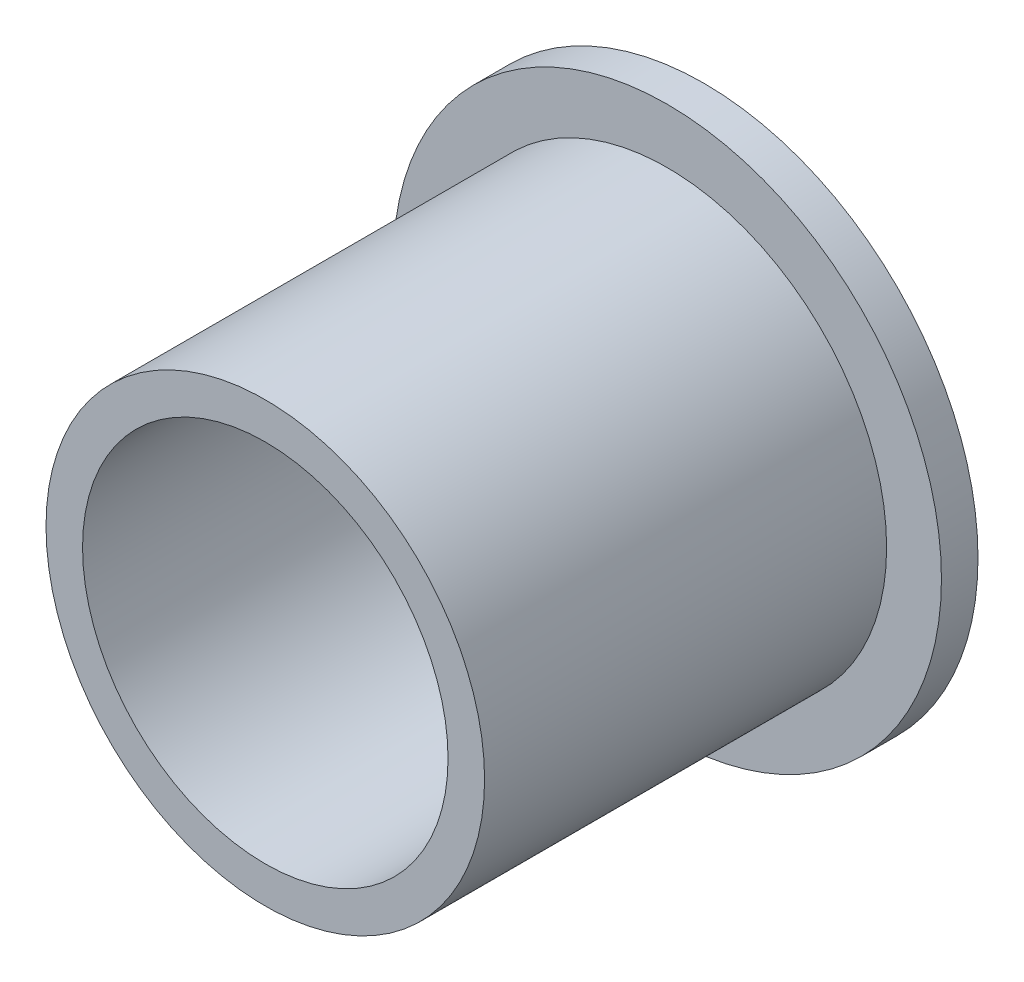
from build123d import *


with BuildPart() as part:
    # Skizze1 → Rotation1 (revolve)
    with BuildSketch(Plane(origin=(0, 0, 0), x_dir=(0, 0, -1), z_dir=(1, 0, 0)), mode=Mode.PRIVATE) as rotation1_sk:
        Polygon((0, 5), (12, 5), (12, 7.5), (11, 7.5), (11, 6), (0, 6), align=None)
    revolve(rotation1_sk.sketch.rotate(Axis((0, 0, 0), (0, 0, -1)), 90), axis=Axis((0, 0, 0), (0, 0, -1)))


solid = part.part
